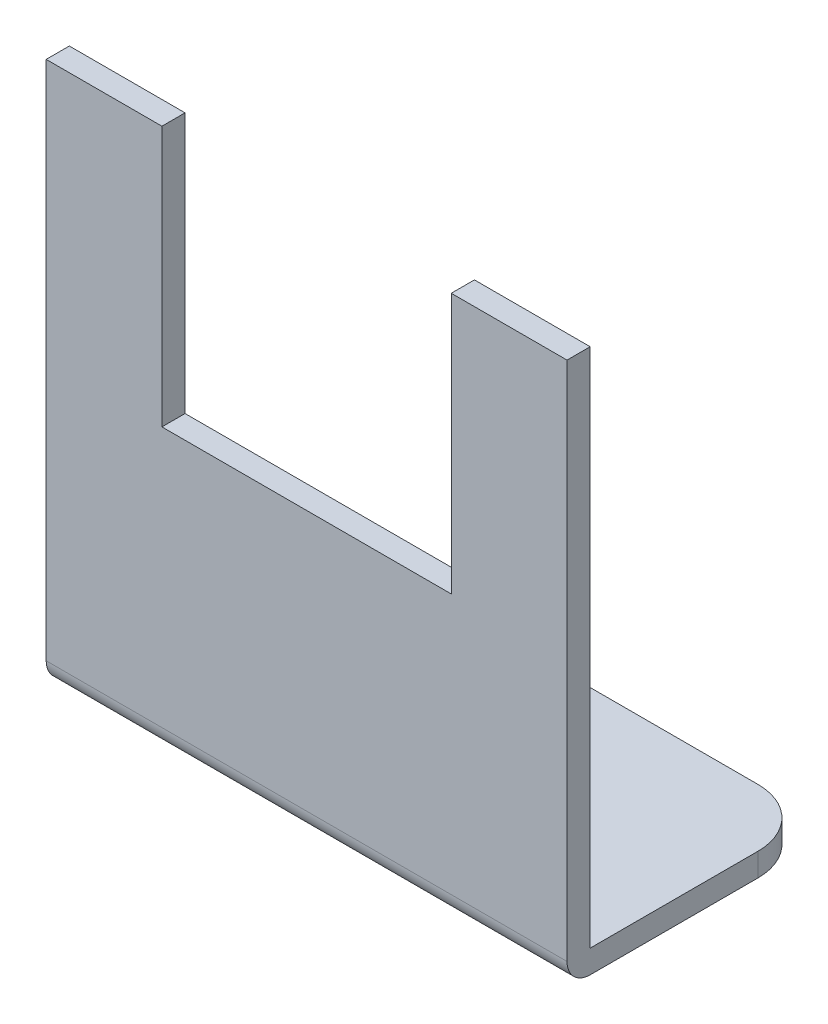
from build123d import *

# Parameters (mm, degrees)
SKETCH1_W           = 45
SKETCH1_H           = 47
BOSS_EXTRUDE1_DEPTH = 2
SKETCH2_W           = 45
SKETCH2_H           = 2
BOSS_EXTRUDE2_DEPTH = 19.5
FILLET1_R           = 2
FILLET2_R           = 5
SKETCH3_W           = 25
SKETCH3_H           = 22.5
CUT_EXTRUDE1_DEPTH  = 39.99679474
SKETCH4_R           = 1.5
CUT_EXTRUDE2_DEPTH  = 54.958317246


with BuildPart() as part:
    # Sketch1 → Boss-Extrude1 (new body)
    with BuildSketch(Plane.XY):
        Rectangle(SKETCH1_W, SKETCH1_H)
    extrude(amount=BOSS_EXTRUDE1_DEPTH)

    # Sketch2 → Boss-Extrude2 (add)
    with BuildSketch(Plane(origin=(0, 0, 0), x_dir=(-1, 0, 0), z_dir=(0, 0, -1))):
        with Locations((0, -22.5)):
            Rectangle(SKETCH2_W, SKETCH2_H)
    extrude(amount=BOSS_EXTRUDE2_DEPTH)

    # Fillet1
    fillet1_edges = [part.edges().sort_by_distance(p)[0] for p in [
        (0, -23.5, 2),
    ]]
    fillet(fillet1_edges, radius=FILLET1_R)

    # Fillet2
    fillet2_edges = [part.edges().sort_by_distance(p)[0] for p in [
        (22.5, -22.5, -19.5),
        (-22.5, -22.5, -19.5),
    ]]
    fillet(fillet2_edges, radius=FILLET2_R)

    # Sketch3 → Cut-Extrude1 (cut, through all)
    with BuildSketch(Plane.XY.offset(2)):
        with Locations((0, 12.25)):
            Rectangle(SKETCH3_W, SKETCH3_H)
    extrude(amount=-CUT_EXTRUDE1_DEPTH, mode=Mode.SUBTRACT)

    # Sketch4 → Cut-Extrude2 (cut, through all)
    with BuildSketch(Plane(origin=(0, -21.5, 0), x_dir=(1, 0, 0), z_dir=(0, 1, 0))):
        with Locations(Location((0, 14.5, 0), (0, 0, 180))):
            Circle(SKETCH4_R)
    extrude(amount=-CUT_EXTRUDE2_DEPTH, mode=Mode.SUBTRACT)


solid = part.part
